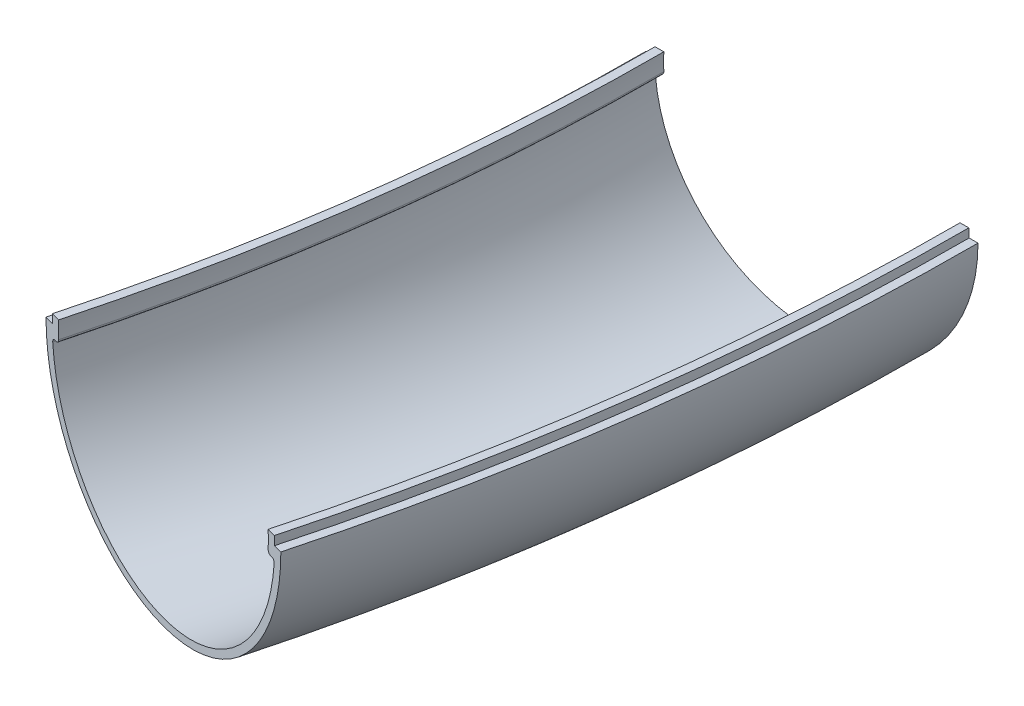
ISO-10303-21;
HEADER;
FILE_DESCRIPTION(('STEP AP214'),'2;1');
FILE_NAME('part.step','',(''),(''),'','','');
FILE_SCHEMA(('AUTOMOTIVE_DESIGN { 1 0 10303 214 1 1 1 1 }'));
ENDSEC;
DATA;
#1=APPLICATION_CONTEXT('core data for automotive mechanical design processes');
#2=APPLICATION_PROTOCOL_DEFINITION('international standard','automotive_design',2000,#1);
#3=PRODUCT_CONTEXT('',#1,'mechanical');
#4=PRODUCT('Part','Part','',(#3));
#5=PRODUCT_RELATED_PRODUCT_CATEGORY('part','',(#4));
#6=PRODUCT_DEFINITION_FORMATION('','',#4);
#7=PRODUCT_DEFINITION_CONTEXT('part definition',#1,'design');
#8=PRODUCT_DEFINITION('design','',#6,#7);
#9=PRODUCT_DEFINITION_SHAPE('','',#8);
#10=(LENGTH_UNIT() NAMED_UNIT(*) SI_UNIT(.MILLI.,.METRE.));
#11=(NAMED_UNIT(*) PLANE_ANGLE_UNIT() SI_UNIT($,.RADIAN.));
#12=(NAMED_UNIT(*) SI_UNIT($,.STERADIAN.) SOLID_ANGLE_UNIT());
#13=UNCERTAINTY_MEASURE_WITH_UNIT(LENGTH_MEASURE(1.E-05),#10,'distance_accuracy_value','');
#14=(GEOMETRIC_REPRESENTATION_CONTEXT(3) GLOBAL_UNCERTAINTY_ASSIGNED_CONTEXT((#13)) GLOBAL_UNIT_ASSIGNED_CONTEXT((#10,
#11,#12)) REPRESENTATION_CONTEXT('',''));
#15=CARTESIAN_POINT('',(0.,0.,0.));
#16=DIRECTION('',(0.,0.,1.));
#17=DIRECTION('',(1.,0.,0.));
#18=AXIS2_PLACEMENT_3D('',#15,#16,#17);
#19=CARTESIAN_POINT('',(0.,-0.795254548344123,0.));
#20=DIRECTION('',(0.,1.,0.));
#21=DIRECTION('',(0.,0.,1.));
#22=AXIS2_PLACEMENT_3D('',#19,#20,#21);
#23=TOROIDAL_SURFACE('',#22,186.323100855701,0.300000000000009);
#24=CARTESIAN_POINT('',(0.,-0.777840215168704,0.));
#25=DIRECTION('',(0.,1.,0.));
#26=DIRECTION('',(0.,0.,1.));
#27=AXIS2_PLACEMENT_3D('',#24,#25,#26);
#28=CIRCLE('',#27,186.622594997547);
#29=CARTESIAN_POINT('',(180.263584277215,-0.777840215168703,48.3014818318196));
#30=VERTEX_POINT('',#29);
#31=CARTESIAN_POINT('',(186.622594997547,-0.777840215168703,0.));
#32=VERTEX_POINT('',#31);
#33=EDGE_CURVE('E11',#30,#32,#28,.T.);
#34=ORIENTED_EDGE('',*,*,#33,.F.);
#35=CARTESIAN_POINT('',(179.974295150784,-0.795254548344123,48.2239670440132));
#36=DIRECTION('',(-0.258819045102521,0.,0.965925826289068));
#37=DIRECTION('',(0.965925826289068,0.,0.258819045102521));
#38=AXIS2_PLACEMENT_3D('',#35,#36,#37);
#39=CIRCLE('',#38,0.300000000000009);
#40=CARTESIAN_POINT('',(179.974295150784,-1.09525454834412,48.2239670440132));
#41=VERTEX_POINT('',#40);
#42=EDGE_CURVE('E232',#30,#41,#39,.F.);
#43=ORIENTED_EDGE('',*,*,#42,.T.);
#44=CARTESIAN_POINT('',(0.,-1.09525454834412,0.));
#45=DIRECTION('',(0.,1.,0.));
#46=DIRECTION('',(0.,0.,1.));
#47=AXIS2_PLACEMENT_3D('',#44,#45,#46);
#48=CIRCLE('',#47,186.323100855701);
#49=CARTESIAN_POINT('',(186.323100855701,-1.09525454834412,0.));
#50=VERTEX_POINT('',#49);
#51=EDGE_CURVE('E59',#41,#50,#48,.T.);
#52=ORIENTED_EDGE('',*,*,#51,.T.);
#53=CARTESIAN_POINT('',(186.323100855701,-0.795254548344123,0.));
#54=DIRECTION('',(0.,0.,1.));
#55=DIRECTION('',(1.,0.,0.));
#56=AXIS2_PLACEMENT_3D('',#53,#54,#55);
#57=CIRCLE('',#56,0.300000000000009);
#58=EDGE_CURVE('E167',#32,#50,#57,.F.);
#59=ORIENTED_EDGE('',*,*,#58,.F.);
#60=EDGE_LOOP('',(#34,#43,#52,#59));
#61=FACE_BOUND('',#60,.T.);
#62=ADVANCED_FACE('F43',(#61),#23,.T.);
#63=CARTESIAN_POINT('',(0.,0.,0.));
#64=DIRECTION('',(0.,1.,0.));
#65=DIRECTION('',(0.,0.,1.));
#66=AXIS2_PLACEMENT_3D('',#63,#64,#65);
#67=TOROIDAL_SURFACE('',#66,200.,13.4);
#68=CARTESIAN_POINT('',(0.,0.776811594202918,0.));
#69=DIRECTION('',(0.,1.,0.));
#70=DIRECTION('',(0.,0.,1.));
#71=AXIS2_PLACEMENT_3D('',#68,#69,#70);
#72=CIRCLE('',#71,186.622535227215);
#73=CARTESIAN_POINT('',(180.263526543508,0.776811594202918,48.3014663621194));
#74=VERTEX_POINT('',#73);
#75=CARTESIAN_POINT('',(186.622535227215,0.776811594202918,0.));
#76=VERTEX_POINT('',#75);
#77=EDGE_CURVE('E52',#74,#76,#72,.T.);
#78=ORIENTED_EDGE('',*,*,#77,.F.);
#79=CARTESIAN_POINT('',(193.185165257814,0.,51.7638090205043));
#80=DIRECTION('',(-0.258819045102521,0.,0.965925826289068));
#81=DIRECTION('',(0.965925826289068,0.,0.258819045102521));
#82=AXIS2_PLACEMENT_3D('',#79,#80,#81);
#83=CIRCLE('',#82,13.4);
#84=EDGE_CURVE('E163',#74,#30,#83,.T.);
#85=ORIENTED_EDGE('',*,*,#84,.T.);
#86=ORIENTED_EDGE('',*,*,#33,.T.);
#87=CARTESIAN_POINT('',(200.,0.,0.));
#88=DIRECTION('',(0.,0.,1.));
#89=DIRECTION('',(1.,0.,0.));
#90=AXIS2_PLACEMENT_3D('',#87,#88,#89);
#91=CIRCLE('',#90,13.4);
#92=EDGE_CURVE('E160',#76,#32,#91,.T.);
#93=ORIENTED_EDGE('',*,*,#92,.F.);
#94=EDGE_LOOP('',(#78,#85,#86,#93));
#95=FACE_BOUND('',#94,.T.);
#96=ADVANCED_FACE('F45',(#95),#67,.F.);
#97=CARTESIAN_POINT('',(0.,0.776811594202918,0.));
#98=DIRECTION('',(0.,1.,0.));
#99=DIRECTION('',(0.,0.,1.));
#100=AXIS2_PLACEMENT_3D('',#97,#98,#99);
#101=PLANE('',#100);
#102=CARTESIAN_POINT('',(0.,0.776811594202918,0.));
#103=DIRECTION('',(0.,1.,0.));
#104=DIRECTION('',(0.,0.,1.));
#105=AXIS2_PLACEMENT_3D('',#102,#103,#104);
#106=CIRCLE('',#105,185.829484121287);
#107=CARTESIAN_POINT('',(179.497497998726,0.776811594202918,48.0962096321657));
#108=VERTEX_POINT('',#107);
#109=CARTESIAN_POINT('',(185.829484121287,0.776811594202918,0.));
#110=VERTEX_POINT('',#109);
#111=EDGE_CURVE('E329',#108,#110,#106,.T.);
#112=ORIENTED_EDGE('',*,*,#111,.F.);
#113=DIRECTION('',(0.965925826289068,0.,0.258819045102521));
#114=VECTOR('',#113,1.);
#115=CARTESIAN_POINT('',(0.,0.776811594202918,0.));
#116=LINE('',#115,#114);
#117=EDGE_CURVE('E237',#108,#74,#116,.T.);
#118=ORIENTED_EDGE('',*,*,#117,.T.);
#119=ORIENTED_EDGE('',*,*,#77,.T.);
#120=DIRECTION('',(1.,0.,0.));
#121=VECTOR('',#120,1.);
#122=CARTESIAN_POINT('',(0.,0.776811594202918,0.));
#123=LINE('',#122,#121);
#124=EDGE_CURVE('E175',#110,#76,#123,.T.);
#125=ORIENTED_EDGE('',*,*,#124,.F.);
#126=EDGE_LOOP('',(#112,#118,#119,#125));
#127=FACE_BOUND('',#126,.T.);
#128=ADVANCED_FACE('F333',(#127),#101,.T.);
#129=CARTESIAN_POINT('',(0.,-0.149999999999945,0.));
#130=DIRECTION('',(0.,1.,0.));
#131=DIRECTION('',(0.,0.,1.));
#132=AXIS2_PLACEMENT_3D('',#129,#130,#131);
#133=TOROIDAL_SURFACE('',#132,200.,14.2007922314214);
#134=CARTESIAN_POINT('',(0.,-5.96050986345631E-12,0.));
#135=DIRECTION('',(0.,1.,0.));
#136=DIRECTION('',(0.,0.,1.));
#137=AXIS2_PLACEMENT_3D('',#134,#135,#136);
#138=CIRCLE('',#137,185.8);
#139=CARTESIAN_POINT('',(179.469018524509,-5.96382400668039E-12,48.0885785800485));
#140=VERTEX_POINT('',#139);
#141=CARTESIAN_POINT('',(185.8,-5.96382400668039E-12,0.));
#142=VERTEX_POINT('',#141);
#143=EDGE_CURVE('E326',#140,#142,#138,.T.);
#144=ORIENTED_EDGE('',*,*,#143,.F.);
#145=CARTESIAN_POINT('',(193.185165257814,-0.149999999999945,51.7638090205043));
#146=DIRECTION('',(-0.258819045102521,0.,0.965925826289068));
#147=DIRECTION('',(0.965925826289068,0.,0.258819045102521));
#148=AXIS2_PLACEMENT_3D('',#145,#146,#147);
#149=CIRCLE('',#148,14.2007922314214);
#150=EDGE_CURVE('E241',#108,#140,#149,.T.);
#151=ORIENTED_EDGE('',*,*,#150,.F.);
#152=ORIENTED_EDGE('',*,*,#111,.T.);
#153=CARTESIAN_POINT('',(200.,-0.149999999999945,0.));
#154=DIRECTION('',(0.,0.,1.));
#155=DIRECTION('',(1.,0.,0.));
#156=AXIS2_PLACEMENT_3D('',#153,#154,#155);
#157=CIRCLE('',#156,14.2007922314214);
#158=EDGE_CURVE('E179',#110,#142,#157,.T.);
#159=ORIENTED_EDGE('',*,*,#158,.T.);
#160=EDGE_LOOP('',(#144,#151,#152,#159));
#161=FACE_BOUND('',#160,.T.);
#162=ADVANCED_FACE('F381',(#161),#133,.T.);
#163=CARTESIAN_POINT('',(0.,-5.95098477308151E-12,0.));
#164=DIRECTION('',(0.,1.,0.));
#165=DIRECTION('',(0.,0.,1.));
#166=AXIS2_PLACEMENT_3D('',#163,#164,#165);
#167=PLANE('',#166);
#168=CARTESIAN_POINT('',(0.,-5.93969318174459E-12,0.));
#169=DIRECTION('',(0.,1.,0.));
#170=DIRECTION('',(0.,0.,1.));
#171=AXIS2_PLACEMENT_3D('',#168,#169,#170);
#172=CIRCLE('',#171,185.);
#173=CARTESIAN_POINT('',(178.696277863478,-5.93814553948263E-12,47.8815233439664));
#174=VERTEX_POINT('',#173);
#175=CARTESIAN_POINT('',(185.,-5.93814553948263E-12,0.));
#176=VERTEX_POINT('',#175);
#177=EDGE_CURVE('E323',#174,#176,#172,.T.);
#178=ORIENTED_EDGE('',*,*,#177,.F.);
#179=DIRECTION('',(0.965925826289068,0.,0.258819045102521));
#180=VECTOR('',#179,1.);
#181=CARTESIAN_POINT('',(0.,0.,0.));
#182=LINE('',#181,#180);
#183=EDGE_CURVE('E245',#174,#140,#182,.T.);
#184=ORIENTED_EDGE('',*,*,#183,.T.);
#185=ORIENTED_EDGE('',*,*,#143,.T.);
#186=DIRECTION('',(1.,0.,0.));
#187=VECTOR('',#186,1.);
#188=CARTESIAN_POINT('',(0.,0.,0.));
#189=LINE('',#188,#187);
#190=EDGE_CURVE('E185',#176,#142,#189,.T.);
#191=ORIENTED_EDGE('',*,*,#190,.F.);
#192=EDGE_LOOP('',(#178,#184,#185,#191));
#193=FACE_BOUND('',#192,.T.);
#194=ADVANCED_FACE('F378',(#193),#167,.T.);
#195=CARTESIAN_POINT('',(0.,0.,0.));
#196=DIRECTION('',(0.,1.,0.));
#197=DIRECTION('',(0.,0.,1.));
#198=AXIS2_PLACEMENT_3D('',#195,#196,#197);
#199=TOROIDAL_SURFACE('',#198,200.,15.);
#200=CARTESIAN_POINT('',(0.,7.13318293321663E-12,0.));
#201=DIRECTION('',(0.,1.,0.));
#202=DIRECTION('',(0.,0.,1.));
#203=AXIS2_PLACEMENT_3D('',#200,#201,#202);
#204=CIRCLE('',#203,215.);
#205=CARTESIAN_POINT('',(207.67405265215,7.13476597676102E-12,55.6460946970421));
#206=VERTEX_POINT('',#205);
#207=CARTESIAN_POINT('',(215.,7.13476597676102E-12,0.));
#208=VERTEX_POINT('',#207);
#209=EDGE_CURVE('E320',#206,#208,#204,.T.);
#210=ORIENTED_EDGE('',*,*,#209,.F.);
#211=CARTESIAN_POINT('',(193.185165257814,0.,51.7638090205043));
#212=DIRECTION('',(-0.258819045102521,0.,0.965925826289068));
#213=DIRECTION('',(0.965925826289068,0.,0.258819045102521));
#214=AXIS2_PLACEMENT_3D('',#211,#212,#213);
#215=CIRCLE('',#214,15.);
#216=EDGE_CURVE('E249',#174,#206,#215,.T.);
#217=ORIENTED_EDGE('',*,*,#216,.F.);
#218=ORIENTED_EDGE('',*,*,#177,.T.);
#219=CARTESIAN_POINT('',(200.,0.,0.));
#220=DIRECTION('',(0.,0.,1.));
#221=DIRECTION('',(1.,0.,0.));
#222=AXIS2_PLACEMENT_3D('',#219,#220,#221);
#223=CIRCLE('',#222,15.);
#224=EDGE_CURVE('E189',#176,#208,#223,.T.);
#225=ORIENTED_EDGE('',*,*,#224,.T.);
#226=EDGE_LOOP('',(#210,#217,#218,#225));
#227=FACE_BOUND('',#226,.T.);
#228=ADVANCED_FACE('F375',(#227),#199,.T.);
#229=CARTESIAN_POINT('',(0.,7.12149199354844E-12,0.));
#230=DIRECTION('',(0.,1.,0.));
#231=DIRECTION('',(0.,0.,1.));
#232=AXIS2_PLACEMENT_3D('',#229,#230,#231);
#233=PLANE('',#232);
#234=CARTESIAN_POINT('',(0.,7.105427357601E-12,0.));
#235=DIRECTION('',(0.,1.,0.));
#236=DIRECTION('',(0.,0.,1.));
#237=AXIS2_PLACEMENT_3D('',#234,#235,#236);
#238=CIRCLE('',#237,214.2);
#239=CARTESIAN_POINT('',(206.901311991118,7.10821801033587E-12,55.4390394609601));
#240=VERTEX_POINT('',#239);
#241=CARTESIAN_POINT('',(214.2,7.10821801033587E-12,0.));
#242=VERTEX_POINT('',#241);
#243=EDGE_CURVE('E317',#240,#242,#238,.T.);
#244=ORIENTED_EDGE('',*,*,#243,.F.);
#245=DIRECTION('',(0.965925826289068,0.,0.258819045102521));
#246=VECTOR('',#245,1.);
#247=CARTESIAN_POINT('',(0.,0.,0.));
#248=LINE('',#247,#246);
#249=EDGE_CURVE('E253',#240,#206,#248,.T.);
#250=ORIENTED_EDGE('',*,*,#249,.T.);
#251=ORIENTED_EDGE('',*,*,#209,.T.);
#252=DIRECTION('',(1.,0.,0.));
#253=VECTOR('',#252,1.);
#254=CARTESIAN_POINT('',(0.,0.,0.));
#255=LINE('',#254,#253);
#256=EDGE_CURVE('E193',#242,#208,#255,.T.);
#257=ORIENTED_EDGE('',*,*,#256,.F.);
#258=EDGE_LOOP('',(#244,#250,#251,#257));
#259=FACE_BOUND('',#258,.T.);
#260=ADVANCED_FACE('F372',(#259),#233,.T.);
#261=CARTESIAN_POINT('',(0.,-0.149999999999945,0.));
#262=DIRECTION('',(0.,1.,0.));
#263=DIRECTION('',(0.,0.,1.));
#264=AXIS2_PLACEMENT_3D('',#261,#262,#263);
#265=TOROIDAL_SURFACE('',#264,200.,14.2007922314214);
#266=CARTESIAN_POINT('',(0.,0.776811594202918,0.));
#267=DIRECTION('',(0.,1.,0.));
#268=DIRECTION('',(0.,0.,1.));
#269=AXIS2_PLACEMENT_3D('',#266,#267,#268);
#270=CIRCLE('',#269,214.170515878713);
#271=CARTESIAN_POINT('',(206.872832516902,0.776811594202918,55.4314084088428));
#272=VERTEX_POINT('',#271);
#273=CARTESIAN_POINT('',(214.170515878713,0.776811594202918,0.));
#274=VERTEX_POINT('',#273);
#275=EDGE_CURVE('E314',#272,#274,#270,.T.);
#276=ORIENTED_EDGE('',*,*,#275,.F.);
#277=CARTESIAN_POINT('',(193.185165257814,-0.149999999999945,51.7638090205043));
#278=DIRECTION('',(-0.258819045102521,0.,0.965925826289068));
#279=DIRECTION('',(0.965925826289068,0.,0.258819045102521));
#280=AXIS2_PLACEMENT_3D('',#277,#278,#279);
#281=CIRCLE('',#280,14.2007922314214);
#282=EDGE_CURVE('E257',#240,#272,#281,.T.);
#283=ORIENTED_EDGE('',*,*,#282,.F.);
#284=ORIENTED_EDGE('',*,*,#243,.T.);
#285=CARTESIAN_POINT('',(200.,-0.149999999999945,0.));
#286=DIRECTION('',(0.,0.,1.));
#287=DIRECTION('',(1.,0.,0.));
#288=AXIS2_PLACEMENT_3D('',#285,#286,#287);
#289=CIRCLE('',#288,14.2007922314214);
#290=EDGE_CURVE('E197',#242,#274,#289,.T.);
#291=ORIENTED_EDGE('',*,*,#290,.T.);
#292=EDGE_LOOP('',(#276,#283,#284,#291));
#293=FACE_BOUND('',#292,.T.);
#294=ADVANCED_FACE('F368',(#293),#265,.T.);
#295=CARTESIAN_POINT('',(0.,0.776811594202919,0.));
#296=DIRECTION('',(0.,1.,0.));
#297=DIRECTION('',(0.,0.,1.));
#298=AXIS2_PLACEMENT_3D('',#295,#296,#297);
#299=PLANE('',#298);
#300=CARTESIAN_POINT('',(0.,0.776811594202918,0.));
#301=DIRECTION('',(0.,1.,0.));
#302=DIRECTION('',(0.,0.,1.));
#303=AXIS2_PLACEMENT_3D('',#300,#301,#302);
#304=CIRCLE('',#303,213.377464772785);
#305=CARTESIAN_POINT('',(206.106803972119,0.776811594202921,55.2261516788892));
#306=VERTEX_POINT('',#305);
#307=CARTESIAN_POINT('',(213.377464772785,0.776811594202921,0.));
#308=VERTEX_POINT('',#307);
#309=EDGE_CURVE('E311',#306,#308,#304,.T.);
#310=ORIENTED_EDGE('',*,*,#309,.F.);
#311=DIRECTION('',(0.965925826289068,0.,0.258819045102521));
#312=VECTOR('',#311,1.);
#313=CARTESIAN_POINT('',(0.,0.776811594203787,0.));
#314=LINE('',#313,#312);
#315=EDGE_CURVE('E261',#306,#272,#314,.T.);
#316=ORIENTED_EDGE('',*,*,#315,.T.);
#317=ORIENTED_EDGE('',*,*,#275,.T.);
#318=DIRECTION('',(1.,0.,0.));
#319=VECTOR('',#318,1.);
#320=CARTESIAN_POINT('',(0.,0.776811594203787,0.));
#321=LINE('',#320,#319);
#322=EDGE_CURVE('E201',#308,#274,#321,.T.);
#323=ORIENTED_EDGE('',*,*,#322,.F.);
#324=EDGE_LOOP('',(#310,#316,#317,#323));
#325=FACE_BOUND('',#324,.T.);
#326=ADVANCED_FACE('F363',(#325),#299,.T.);
#327=CARTESIAN_POINT('',(0.,0.,0.));
#328=DIRECTION('',(0.,1.,0.));
#329=DIRECTION('',(0.,0.,1.));
#330=AXIS2_PLACEMENT_3D('',#327,#328,#329);
#331=TOROIDAL_SURFACE('',#330,200.,13.4);
#332=CARTESIAN_POINT('',(0.,-0.777840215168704,0.));
#333=DIRECTION('',(0.,1.,0.));
#334=DIRECTION('',(0.,0.,1.));
#335=AXIS2_PLACEMENT_3D('',#332,#333,#334);
#336=CIRCLE('',#335,213.377405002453);
#337=CARTESIAN_POINT('',(206.106746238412,-0.777840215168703,55.226136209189));
#338=VERTEX_POINT('',#337);
#339=CARTESIAN_POINT('',(213.377405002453,-0.777840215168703,0.));
#340=VERTEX_POINT('',#339);
#341=EDGE_CURVE('E308',#338,#340,#336,.T.);
#342=ORIENTED_EDGE('',*,*,#341,.F.);
#343=CARTESIAN_POINT('',(193.185165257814,0.,51.7638090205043));
#344=DIRECTION('',(-0.258819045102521,0.,0.965925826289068));
#345=DIRECTION('',(0.965925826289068,0.,0.258819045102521));
#346=AXIS2_PLACEMENT_3D('',#343,#344,#345);
#347=CIRCLE('',#346,13.4);
#348=EDGE_CURVE('E265',#338,#306,#347,.T.);
#349=ORIENTED_EDGE('',*,*,#348,.T.);
#350=ORIENTED_EDGE('',*,*,#309,.T.);
#351=CARTESIAN_POINT('',(200.,0.,0.));
#352=DIRECTION('',(0.,0.,1.));
#353=DIRECTION('',(1.,0.,0.));
#354=AXIS2_PLACEMENT_3D('',#351,#352,#353);
#355=CIRCLE('',#354,13.4);
#356=EDGE_CURVE('E205',#340,#308,#355,.T.);
#357=ORIENTED_EDGE('',*,*,#356,.F.);
#358=EDGE_LOOP('',(#342,#349,#350,#357));
#359=FACE_BOUND('',#358,.T.);
#360=ADVANCED_FACE('F359',(#359),#331,.F.);
#361=CARTESIAN_POINT('',(0.,-0.795254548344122,0.));
#362=DIRECTION('',(0.,1.,0.));
#363=DIRECTION('',(0.,0.,1.));
#364=AXIS2_PLACEMENT_3D('',#361,#362,#363);
#365=TOROIDAL_SURFACE('',#364,213.676899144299,0.300000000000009);
#366=CARTESIAN_POINT('',(0.,-1.09525454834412,0.));
#367=DIRECTION('',(0.,1.,0.));
#368=DIRECTION('',(0.,0.,1.));
#369=AXIS2_PLACEMENT_3D('',#366,#367,#368);
#370=CIRCLE('',#369,213.676899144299);
#371=CARTESIAN_POINT('',(206.396035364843,-1.09525454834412,55.3036509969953));
#372=VERTEX_POINT('',#371);
#373=CARTESIAN_POINT('',(213.676899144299,-1.09525454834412,0.));
#374=VERTEX_POINT('',#373);
#375=EDGE_CURVE('E305',#372,#374,#370,.T.);
#376=ORIENTED_EDGE('',*,*,#375,.F.);
#377=CARTESIAN_POINT('',(206.396035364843,-0.795254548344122,55.3036509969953));
#378=DIRECTION('',(-0.258819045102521,0.,0.965925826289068));
#379=DIRECTION('',(0.965925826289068,0.,0.258819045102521));
#380=AXIS2_PLACEMENT_3D('',#377,#378,#379);
#381=CIRCLE('',#380,0.300000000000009);
#382=EDGE_CURVE('E269',#338,#372,#381,.T.);
#383=ORIENTED_EDGE('',*,*,#382,.F.);
#384=ORIENTED_EDGE('',*,*,#341,.T.);
#385=CARTESIAN_POINT('',(213.676899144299,-0.795254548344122,0.));
#386=DIRECTION('',(0.,0.,1.));
#387=DIRECTION('',(1.,0.,0.));
#388=AXIS2_PLACEMENT_3D('',#385,#386,#387);
#389=CIRCLE('',#388,0.300000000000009);
#390=EDGE_CURVE('E209',#340,#374,#389,.T.);
#391=ORIENTED_EDGE('',*,*,#390,.T.);
#392=EDGE_LOOP('',(#376,#383,#384,#391));
#393=FACE_BOUND('',#392,.T.);
#394=ADVANCED_FACE('F355',(#393),#365,.T.);
#395=CARTESIAN_POINT('',(0.,-1.09525454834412,0.));
#396=DIRECTION('',(0.,1.,0.));
#397=DIRECTION('',(0.,0.,1.));
#398=AXIS2_PLACEMENT_3D('',#395,#396,#397);
#399=PLANE('',#398);
#400=CARTESIAN_POINT('',(0.,-1.09525454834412,0.));
#401=DIRECTION('',(0.,1.,0.));
#402=DIRECTION('',(0.,0.,1.));
#403=AXIS2_PLACEMENT_3D('',#400,#401,#402);
#404=CIRCLE('',#403,213.844903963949);
#405=CARTESIAN_POINT('',(206.558315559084,-1.09525454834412,55.3471338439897));
#406=VERTEX_POINT('',#405);
#407=CARTESIAN_POINT('',(213.844903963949,-1.09525454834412,0.));
#408=VERTEX_POINT('',#407);
#409=EDGE_CURVE('E302',#406,#408,#404,.T.);
#410=ORIENTED_EDGE('',*,*,#409,.F.);
#411=DIRECTION('',(0.965925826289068,0.,0.258819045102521));
#412=VECTOR('',#411,1.);
#413=CARTESIAN_POINT('',(0.,-1.09525454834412,0.));
#414=LINE('',#413,#412);
#415=EDGE_CURVE('E273',#372,#406,#414,.T.);
#416=ORIENTED_EDGE('',*,*,#415,.F.);
#417=ORIENTED_EDGE('',*,*,#375,.T.);
#418=DIRECTION('',(1.,0.,0.));
#419=VECTOR('',#418,1.);
#420=CARTESIAN_POINT('',(0.,-1.09525454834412,0.));
#421=LINE('',#420,#419);
#422=EDGE_CURVE('E213',#374,#408,#421,.T.);
#423=ORIENTED_EDGE('',*,*,#422,.T.);
#424=EDGE_LOOP('',(#410,#416,#417,#423));
#425=FACE_BOUND('',#424,.T.);
#426=ADVANCED_FACE('F351',(#425),#399,.F.);
#427=CARTESIAN_POINT('',(0.,-1.39525454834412,0.));
#428=DIRECTION('',(0.,1.,0.));
#429=DIRECTION('',(0.,0.,1.));
#430=AXIS2_PLACEMENT_3D('',#427,#428,#429);
#431=TOROIDAL_SURFACE('',#430,213.844903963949,0.300000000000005);
#432=CARTESIAN_POINT('',(0.,-1.42212901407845,0.));
#433=DIRECTION('',(0.,1.,0.));
#434=DIRECTION('',(0.,0.,1.));
#435=AXIS2_PLACEMENT_3D('',#432,#433,#434);
#436=CIRCLE('',#435,214.143697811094);
#437=CARTESIAN_POINT('',(206.846928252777,-1.42212901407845,55.4244673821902));
#438=VERTEX_POINT('',#437);
#439=CARTESIAN_POINT('',(214.143697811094,-1.42212901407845,0.));
#440=VERTEX_POINT('',#439);
#441=EDGE_CURVE('E299',#438,#440,#436,.T.);
#442=ORIENTED_EDGE('',*,*,#441,.F.);
#443=CARTESIAN_POINT('',(206.558315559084,-1.39525454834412,55.3471338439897));
#444=DIRECTION('',(-0.258819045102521,0.,0.965925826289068));
#445=DIRECTION('',(0.965925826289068,0.,0.258819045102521));
#446=AXIS2_PLACEMENT_3D('',#443,#444,#445);
#447=CIRCLE('',#446,0.300000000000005);
#448=EDGE_CURVE('E277',#406,#438,#447,.F.);
#449=ORIENTED_EDGE('',*,*,#448,.F.);
#450=ORIENTED_EDGE('',*,*,#409,.T.);
#451=CARTESIAN_POINT('',(213.844903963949,-1.39525454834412,0.));
#452=DIRECTION('',(0.,0.,1.));
#453=DIRECTION('',(1.,0.,0.));
#454=AXIS2_PLACEMENT_3D('',#451,#452,#453);
#455=CIRCLE('',#454,0.300000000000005);
#456=EDGE_CURVE('E217',#408,#440,#455,.F.);
#457=ORIENTED_EDGE('',*,*,#456,.T.);
#458=EDGE_LOOP('',(#442,#449,#450,#457));
#459=FACE_BOUND('',#458,.T.);
#460=ADVANCED_FACE('F348',(#459),#431,.F.);
#461=CARTESIAN_POINT('',(0.,-0.149999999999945,0.));
#462=DIRECTION('',(0.,1.,0.));
#463=DIRECTION('',(0.,0.,1.));
#464=AXIS2_PLACEMENT_3D('',#461,#462,#463);
#465=TOROIDAL_SURFACE('',#464,200.,14.2007922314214);
#466=CARTESIAN_POINT('',(0.,-1.42212901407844,0.));
#467=DIRECTION('',(0.,1.,0.));
#468=DIRECTION('',(0.,0.,1.));
#469=AXIS2_PLACEMENT_3D('',#466,#467,#468);
#470=CIRCLE('',#469,185.856302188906);
#471=CARTESIAN_POINT('',(179.52340226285,-1.42212901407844,48.1031506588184));
#472=VERTEX_POINT('',#471);
#473=CARTESIAN_POINT('',(185.856302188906,-1.42212901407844,0.));
#474=VERTEX_POINT('',#473);
#475=EDGE_CURVE('E296',#472,#474,#470,.T.);
#476=ORIENTED_EDGE('',*,*,#475,.F.);
#477=CARTESIAN_POINT('',(193.185165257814,-0.149999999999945,51.7638090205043));
#478=DIRECTION('',(-0.258819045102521,0.,0.965925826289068));
#479=DIRECTION('',(0.965925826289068,0.,0.258819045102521));
#480=AXIS2_PLACEMENT_3D('',#477,#478,#479);
#481=CIRCLE('',#480,14.2007922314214);
#482=EDGE_CURVE('E281',#472,#438,#481,.T.);
#483=ORIENTED_EDGE('',*,*,#482,.T.);
#484=ORIENTED_EDGE('',*,*,#441,.T.);
#485=CARTESIAN_POINT('',(200.,-0.149999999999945,0.));
#486=DIRECTION('',(0.,0.,1.));
#487=DIRECTION('',(1.,0.,0.));
#488=AXIS2_PLACEMENT_3D('',#485,#486,#487);
#489=CIRCLE('',#488,14.2007922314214);
#490=EDGE_CURVE('E221',#474,#440,#489,.T.);
#491=ORIENTED_EDGE('',*,*,#490,.F.);
#492=EDGE_LOOP('',(#476,#483,#484,#491));
#493=FACE_BOUND('',#492,.T.);
#494=ADVANCED_FACE('F345',(#493),#465,.F.);
#495=CARTESIAN_POINT('',(0.,-1.39525454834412,0.));
#496=DIRECTION('',(0.,1.,0.));
#497=DIRECTION('',(0.,0.,1.));
#498=AXIS2_PLACEMENT_3D('',#495,#496,#497);
#499=TOROIDAL_SURFACE('',#498,186.155096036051,0.300000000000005);
#500=CARTESIAN_POINT('',(0.,-1.09525454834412,0.));
#501=DIRECTION('',(0.,1.,0.));
#502=DIRECTION('',(0.,0.,1.));
#503=AXIS2_PLACEMENT_3D('',#500,#501,#502);
#504=CIRCLE('',#503,186.155096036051);
#505=CARTESIAN_POINT('',(179.812014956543,-1.09525454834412,48.1804841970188));
#506=VERTEX_POINT('',#505);
#507=CARTESIAN_POINT('',(186.155096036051,-1.09525454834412,0.));
#508=VERTEX_POINT('',#507);
#509=EDGE_CURVE('E67',#506,#508,#504,.T.);
#510=ORIENTED_EDGE('',*,*,#509,.F.);
#511=CARTESIAN_POINT('',(179.812014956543,-1.39525454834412,48.1804841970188));
#512=DIRECTION('',(-0.258819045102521,0.,0.965925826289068));
#513=DIRECTION('',(0.965925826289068,0.,0.258819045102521));
#514=AXIS2_PLACEMENT_3D('',#511,#512,#513);
#515=CIRCLE('',#514,0.300000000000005);
#516=EDGE_CURVE('E285',#506,#472,#515,.T.);
#517=ORIENTED_EDGE('',*,*,#516,.T.);
#518=ORIENTED_EDGE('',*,*,#475,.T.);
#519=CARTESIAN_POINT('',(186.155096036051,-1.39525454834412,0.));
#520=DIRECTION('',(0.,0.,1.));
#521=DIRECTION('',(1.,0.,0.));
#522=AXIS2_PLACEMENT_3D('',#519,#520,#521);
#523=CIRCLE('',#522,0.300000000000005);
#524=EDGE_CURVE('E225',#508,#474,#523,.T.);
#525=ORIENTED_EDGE('',*,*,#524,.F.);
#526=EDGE_LOOP('',(#510,#517,#518,#525));
#527=FACE_BOUND('',#526,.T.);
#528=ADVANCED_FACE('F340',(#527),#499,.F.);
#529=CARTESIAN_POINT('',(0.,-1.09525454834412,0.));
#530=DIRECTION('',(0.,1.,0.));
#531=DIRECTION('',(0.,0.,1.));
#532=AXIS2_PLACEMENT_3D('',#529,#530,#531);
#533=PLANE('',#532);
#534=DIRECTION('',(0.965925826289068,0.,0.258819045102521));
#535=VECTOR('',#534,1.);
#536=CARTESIAN_POINT('',(0.,-1.09525454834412,0.));
#537=LINE('',#536,#535);
#538=EDGE_CURVE('E288',#506,#41,#537,.T.);
#539=ORIENTED_EDGE('',*,*,#538,.F.);
#540=ORIENTED_EDGE('',*,*,#509,.T.);
#541=DIRECTION('',(1.,0.,0.));
#542=VECTOR('',#541,1.);
#543=CARTESIAN_POINT('',(0.,-1.09525454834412,0.));
#544=LINE('',#543,#542);
#545=EDGE_CURVE('E229',#508,#50,#544,.T.);
#546=ORIENTED_EDGE('',*,*,#545,.T.);
#547=ORIENTED_EDGE('',*,*,#51,.F.);
#548=EDGE_LOOP('',(#539,#540,#546,#547));
#549=FACE_BOUND('',#548,.T.);
#550=ADVANCED_FACE('F339',(#549),#533,.F.);
#551=CARTESIAN_POINT('',(0.,0.,0.));
#552=DIRECTION('',(-0.258819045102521,0.,0.965925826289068));
#553=DIRECTION('',(0.965925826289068,0.,0.258819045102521));
#554=AXIS2_PLACEMENT_3D('',#551,#552,#553);
#555=PLANE('',#554);
#556=ORIENTED_EDGE('',*,*,#42,.F.);
#557=ORIENTED_EDGE('',*,*,#84,.F.);
#558=ORIENTED_EDGE('',*,*,#117,.F.);
#559=ORIENTED_EDGE('',*,*,#150,.T.);
#560=ORIENTED_EDGE('',*,*,#183,.F.);
#561=ORIENTED_EDGE('',*,*,#216,.T.);
#562=ORIENTED_EDGE('',*,*,#249,.F.);
#563=ORIENTED_EDGE('',*,*,#282,.T.);
#564=ORIENTED_EDGE('',*,*,#315,.F.);
#565=ORIENTED_EDGE('',*,*,#348,.F.);
#566=ORIENTED_EDGE('',*,*,#382,.T.);
#567=ORIENTED_EDGE('',*,*,#415,.T.);
#568=ORIENTED_EDGE('',*,*,#448,.T.);
#569=ORIENTED_EDGE('',*,*,#482,.F.);
#570=ORIENTED_EDGE('',*,*,#516,.F.);
#571=ORIENTED_EDGE('',*,*,#538,.T.);
#572=EDGE_LOOP('',(#556,#557,#558,#559,#560,#561,#562,#563,#564,#565,#566,#567,#568,#569,#570,#571));
#573=FACE_BOUND('',#572,.T.);
#574=ADVANCED_FACE('F336',(#573),#555,.T.);
#575=CARTESIAN_POINT('',(0.,0.,0.));
#576=DIRECTION('',(0.,0.,1.));
#577=DIRECTION('',(1.,0.,0.));
#578=AXIS2_PLACEMENT_3D('',#575,#576,#577);
#579=PLANE('',#578);
#580=ORIENTED_EDGE('',*,*,#58,.T.);
#581=ORIENTED_EDGE('',*,*,#545,.F.);
#582=ORIENTED_EDGE('',*,*,#524,.T.);
#583=ORIENTED_EDGE('',*,*,#490,.T.);
#584=ORIENTED_EDGE('',*,*,#456,.F.);
#585=ORIENTED_EDGE('',*,*,#422,.F.);
#586=ORIENTED_EDGE('',*,*,#390,.F.);
#587=ORIENTED_EDGE('',*,*,#356,.T.);
#588=ORIENTED_EDGE('',*,*,#322,.T.);
#589=ORIENTED_EDGE('',*,*,#290,.F.);
#590=ORIENTED_EDGE('',*,*,#256,.T.);
#591=ORIENTED_EDGE('',*,*,#224,.F.);
#592=ORIENTED_EDGE('',*,*,#190,.T.);
#593=ORIENTED_EDGE('',*,*,#158,.F.);
#594=ORIENTED_EDGE('',*,*,#124,.T.);
#595=ORIENTED_EDGE('',*,*,#92,.T.);
#596=EDGE_LOOP('',(#580,#581,#582,#583,#584,#585,#586,#587,#588,#589,#590,#591,#592,#593,#594,#595));
#597=FACE_BOUND('',#596,.T.);
#598=ADVANCED_FACE('F172',(#597),#579,.F.);
#599=CLOSED_SHELL('',(#62,#96,#128,#162,#194,#228,#260,#294,#326,#360,#394,#426,#460,#494,#528,
#550,#574,#598));
#600=MANIFOLD_SOLID_BREP('B2',#599);
#601=ADVANCED_BREP_SHAPE_REPRESENTATION('',(#18,#600),#14);
#602=SHAPE_DEFINITION_REPRESENTATION(#9,#601);
ENDSEC;
END-ISO-10303-21;
